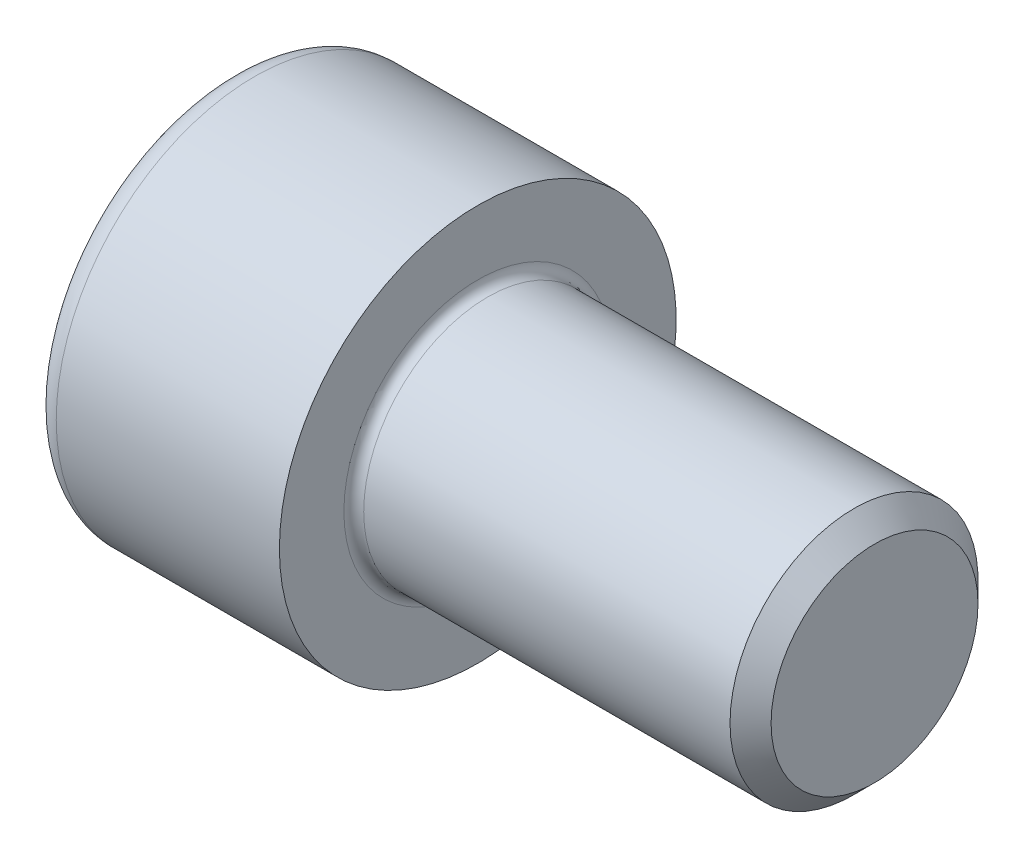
ISO-10303-21;
HEADER;
FILE_DESCRIPTION(('STEP AP214'),'2;1');
FILE_NAME('part.step','',(''),(''),'','','');
FILE_SCHEMA(('AUTOMOTIVE_DESIGN { 1 0 10303 214 1 1 1 1 }'));
ENDSEC;
DATA;
#1=APPLICATION_CONTEXT('core data for automotive mechanical design processes');
#2=APPLICATION_PROTOCOL_DEFINITION('international standard','automotive_design',2000,#1);
#3=PRODUCT_CONTEXT('',#1,'mechanical');
#4=PRODUCT('Part','Part','',(#3));
#5=PRODUCT_RELATED_PRODUCT_CATEGORY('part','',(#4));
#6=PRODUCT_DEFINITION_FORMATION('','',#4);
#7=PRODUCT_DEFINITION_CONTEXT('part definition',#1,'design');
#8=PRODUCT_DEFINITION('design','',#6,#7);
#9=PRODUCT_DEFINITION_SHAPE('','',#8);
#10=(LENGTH_UNIT() NAMED_UNIT(*) SI_UNIT(.MILLI.,.METRE.));
#11=(NAMED_UNIT(*) PLANE_ANGLE_UNIT() SI_UNIT($,.RADIAN.));
#12=(NAMED_UNIT(*) SI_UNIT($,.STERADIAN.) SOLID_ANGLE_UNIT());
#13=UNCERTAINTY_MEASURE_WITH_UNIT(LENGTH_MEASURE(1.E-05),#10,'distance_accuracy_value','');
#14=(GEOMETRIC_REPRESENTATION_CONTEXT(3) GLOBAL_UNCERTAINTY_ASSIGNED_CONTEXT((#13)) GLOBAL_UNIT_ASSIGNED_CONTEXT((#10,
#11,#12)) REPRESENTATION_CONTEXT('',''));
#15=CARTESIAN_POINT('',(0.,0.,0.));
#16=DIRECTION('',(0.,0.,1.));
#17=DIRECTION('',(1.,0.,0.));
#18=AXIS2_PLACEMENT_3D('',#15,#16,#17);
#19=CARTESIAN_POINT('',(0.,0.,0.));
#20=DIRECTION('',(-1.,0.,0.));
#21=DIRECTION('',(0.,0.,1.));
#22=AXIS2_PLACEMENT_3D('',#19,#20,#21);
#23=PLANE('',#22);
#24=DIRECTION('',(0.,-0.499999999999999,0.866025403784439));
#25=VECTOR('',#24,1.);
#26=CARTESIAN_POINT('',(0.,4.63323591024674,0.));
#27=LINE('',#26,#25);
#28=CARTESIAN_POINT('',(0.,4.63323591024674,0.));
#29=VERTEX_POINT('',#28);
#30=CARTESIAN_POINT('',(0.,2.31661795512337,4.01249999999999));
#31=VERTEX_POINT('',#30);
#32=EDGE_CURVE('E258',#29,#31,#27,.T.);
#33=ORIENTED_EDGE('',*,*,#32,.T.);
#34=DIRECTION('',(0.,1.,0.));
#35=VECTOR('',#34,1.);
#36=CARTESIAN_POINT('',(0.,-2.31661795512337,4.0125));
#37=LINE('',#36,#35);
#38=CARTESIAN_POINT('',(0.,-2.31661795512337,4.0125));
#39=VERTEX_POINT('',#38);
#40=EDGE_CURVE('E130',#39,#31,#37,.T.);
#41=ORIENTED_EDGE('',*,*,#40,.F.);
#42=DIRECTION('',(0.,-0.500000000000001,-0.866025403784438));
#43=VECTOR('',#42,1.);
#44=CARTESIAN_POINT('',(0.,-2.31661795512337,4.0125));
#45=LINE('',#44,#43);
#46=CARTESIAN_POINT('',(0.,-4.63323591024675,0.));
#47=VERTEX_POINT('',#46);
#48=EDGE_CURVE('E261',#39,#47,#45,.T.);
#49=ORIENTED_EDGE('',*,*,#48,.T.);
#50=DIRECTION('',(0.,0.499999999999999,-0.866025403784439));
#51=VECTOR('',#50,1.);
#52=CARTESIAN_POINT('',(0.,-4.63323591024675,0.));
#53=LINE('',#52,#51);
#54=CARTESIAN_POINT('',(0.,-2.31661795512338,-4.0125));
#55=VERTEX_POINT('',#54);
#56=EDGE_CURVE('E264',#47,#55,#53,.T.);
#57=ORIENTED_EDGE('',*,*,#56,.T.);
#58=DIRECTION('',(0.,-1.,0.));
#59=VECTOR('',#58,1.);
#60=CARTESIAN_POINT('',(0.,2.31661795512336,-4.0125));
#61=LINE('',#60,#59);
#62=CARTESIAN_POINT('',(0.,2.31661795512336,-4.0125));
#63=VERTEX_POINT('',#62);
#64=EDGE_CURVE('E267',#63,#55,#61,.T.);
#65=ORIENTED_EDGE('',*,*,#64,.F.);
#66=DIRECTION('',(0.,-0.500000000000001,-0.866025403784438));
#67=VECTOR('',#66,1.);
#68=CARTESIAN_POINT('',(0.,4.63323591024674,0.));
#69=LINE('',#68,#67);
#70=EDGE_CURVE('E125',#29,#63,#69,.T.);
#71=ORIENTED_EDGE('',*,*,#70,.F.);
#72=EDGE_LOOP('',(#33,#41,#49,#57,#65,#71));
#73=FACE_BOUND('',#72,.T.);
#74=CARTESIAN_POINT('',(0.,0.,0.));
#75=DIRECTION('',(-1.,0.,0.));
#76=DIRECTION('',(0.,0.,1.));
#77=AXIS2_PLACEMENT_3D('',#74,#75,#76);
#78=CIRCLE('',#77,7.);
#79=CARTESIAN_POINT('',(0.,0.,7.));
#80=VERTEX_POINT('',#79);
#81=EDGE_CURVE('E42',#80,#80,#78,.T.);
#82=ORIENTED_EDGE('',*,*,#81,.T.);
#83=EDGE_LOOP('',(#82));
#84=FACE_BOUND('',#83,.T.);
#85=ADVANCED_FACE('F34',(#73,#84),#23,.T.);
#86=CARTESIAN_POINT('',(-31.75,0.,0.));
#87=DIRECTION('',(-1.,0.,0.));
#88=DIRECTION('',(0.,0.,1.));
#89=AXIS2_PLACEMENT_3D('',#86,#87,#88);
#90=CYLINDRICAL_SURFACE('',#89,8.);
#91=CARTESIAN_POINT('',(1.,0.,0.));
#92=DIRECTION('',(-1.,0.,0.));
#93=DIRECTION('',(0.,0.,1.));
#94=AXIS2_PLACEMENT_3D('',#91,#92,#93);
#95=CIRCLE('',#94,8.);
#96=CARTESIAN_POINT('',(1.,0.,8.));
#97=VERTEX_POINT('',#96);
#98=EDGE_CURVE('E11',#97,#97,#95,.F.);
#99=ORIENTED_EDGE('',*,*,#98,.T.);
#100=EDGE_LOOP('',(#99));
#101=FACE_BOUND('',#100,.T.);
#102=CARTESIAN_POINT('',(9.99999999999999,0.,0.));
#103=DIRECTION('',(-1.,0.,0.));
#104=DIRECTION('',(0.,0.,1.));
#105=AXIS2_PLACEMENT_3D('',#102,#103,#104);
#106=CIRCLE('',#105,8.);
#107=CARTESIAN_POINT('',(9.99999999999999,0.,8.));
#108=VERTEX_POINT('',#107);
#109=EDGE_CURVE('E148',#108,#108,#106,.T.);
#110=ORIENTED_EDGE('',*,*,#109,.T.);
#111=EDGE_LOOP('',(#110));
#112=FACE_BOUND('',#111,.T.);
#113=ADVANCED_FACE('F172',(#101,#112),#90,.T.);
#114=CARTESIAN_POINT('',(10.,8.,0.));
#115=DIRECTION('',(1.,0.,0.));
#116=DIRECTION('',(0.,0.,-1.));
#117=AXIS2_PLACEMENT_3D('',#114,#115,#116);
#118=PLANE('',#117);
#119=CARTESIAN_POINT('',(10.,0.,0.));
#120=DIRECTION('',(1.,0.,0.));
#121=DIRECTION('',(0.,0.,-1.));
#122=AXIS2_PLACEMENT_3D('',#119,#120,#121);
#123=CIRCLE('',#122,5.4);
#124=CARTESIAN_POINT('',(10.,0.,-5.4));
#125=VERTEX_POINT('',#124);
#126=EDGE_CURVE('E151',#125,#125,#123,.F.);
#127=ORIENTED_EDGE('',*,*,#126,.T.);
#128=EDGE_LOOP('',(#127));
#129=FACE_BOUND('',#128,.T.);
#130=ORIENTED_EDGE('',*,*,#109,.F.);
#131=EDGE_LOOP('',(#130));
#132=FACE_BOUND('',#131,.T.);
#133=ADVANCED_FACE('F178',(#129,#132),#118,.T.);
#134=CARTESIAN_POINT('',(-31.75,0.,0.));
#135=DIRECTION('',(-1.,0.,0.));
#136=DIRECTION('',(0.,0.,1.));
#137=AXIS2_PLACEMENT_3D('',#134,#135,#136);
#138=CYLINDRICAL_SURFACE('',#137,5.);
#139=CARTESIAN_POINT('',(10.4,0.,0.));
#140=DIRECTION('',(1.,0.,0.));
#141=DIRECTION('',(0.,0.,-1.));
#142=AXIS2_PLACEMENT_3D('',#139,#140,#141);
#143=CIRCLE('',#142,5.);
#144=CARTESIAN_POINT('',(10.4,0.,-5.));
#145=VERTEX_POINT('',#144);
#146=EDGE_CURVE('E154',#145,#145,#143,.T.);
#147=ORIENTED_EDGE('',*,*,#146,.T.);
#148=EDGE_LOOP('',(#147));
#149=FACE_BOUND('',#148,.T.);
#150=CARTESIAN_POINT('',(25.172,0.,0.));
#151=DIRECTION('',(-1.,0.,0.));
#152=DIRECTION('',(0.,0.,1.));
#153=AXIS2_PLACEMENT_3D('',#150,#151,#152);
#154=CIRCLE('',#153,5.);
#155=CARTESIAN_POINT('',(25.172,0.,5.));
#156=VERTEX_POINT('',#155);
#157=EDGE_CURVE('E145',#156,#156,#154,.T.);
#158=ORIENTED_EDGE('',*,*,#157,.T.);
#159=EDGE_LOOP('',(#158));
#160=FACE_BOUND('',#159,.T.);
#161=ADVANCED_FACE('F184',(#149,#160),#138,.T.);
#162=CARTESIAN_POINT('',(26.,0.,0.));
#163=DIRECTION('',(-1.,0.,0.));
#164=DIRECTION('',(0.,0.,1.));
#165=AXIS2_PLACEMENT_3D('',#162,#163,#164);
#166=CONICAL_SURFACE('',#165,4.172,0.785398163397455);
#167=ORIENTED_EDGE('',*,*,#157,.F.);
#168=EDGE_LOOP('',(#167));
#169=FACE_BOUND('',#168,.T.);
#170=CARTESIAN_POINT('',(26.,0.,0.));
#171=DIRECTION('',(-1.,0.,0.));
#172=DIRECTION('',(0.,0.,1.));
#173=AXIS2_PLACEMENT_3D('',#170,#171,#172);
#174=CIRCLE('',#173,4.172);
#175=CARTESIAN_POINT('',(26.,0.,4.172));
#176=VERTEX_POINT('',#175);
#177=EDGE_CURVE('E141',#176,#176,#174,.T.);
#178=ORIENTED_EDGE('',*,*,#177,.T.);
#179=EDGE_LOOP('',(#178));
#180=FACE_BOUND('',#179,.T.);
#181=ADVANCED_FACE('F188',(#169,#180),#166,.T.);
#182=CARTESIAN_POINT('',(26.,4.172,0.));
#183=DIRECTION('',(1.,0.,0.));
#184=DIRECTION('',(0.,0.,-1.));
#185=AXIS2_PLACEMENT_3D('',#182,#183,#184);
#186=PLANE('',#185);
#187=ORIENTED_EDGE('',*,*,#177,.F.);
#188=EDGE_LOOP('',(#187));
#189=FACE_BOUND('',#188,.T.);
#190=ADVANCED_FACE('F168',(#189),#186,.T.);
#191=CARTESIAN_POINT('',(10.4,0.,0.));
#192=DIRECTION('',(1.,0.,0.));
#193=DIRECTION('',(0.,0.,-1.));
#194=AXIS2_PLACEMENT_3D('',#191,#192,#193);
#195=TOROIDAL_SURFACE('',#194,5.4,0.4);
#196=ORIENTED_EDGE('',*,*,#146,.F.);
#197=EDGE_LOOP('',(#196));
#198=FACE_BOUND('',#197,.T.);
#199=ORIENTED_EDGE('',*,*,#126,.F.);
#200=EDGE_LOOP('',(#199));
#201=FACE_BOUND('',#200,.T.);
#202=ADVANCED_FACE('F161',(#198,#201),#195,.F.);
#203=CARTESIAN_POINT('',(1.,0.,0.));
#204=DIRECTION('',(-1.,0.,0.));
#205=DIRECTION('',(0.,0.,1.));
#206=AXIS2_PLACEMENT_3D('',#203,#204,#205);
#207=TOROIDAL_SURFACE('',#206,7.,1.);
#208=ORIENTED_EDGE('',*,*,#98,.F.);
#209=EDGE_LOOP('',(#208));
#210=FACE_BOUND('',#209,.T.);
#211=ORIENTED_EDGE('',*,*,#81,.F.);
#212=EDGE_LOOP('',(#211));
#213=FACE_BOUND('',#212,.T.);
#214=ADVANCED_FACE('F36',(#210,#213),#207,.T.);
#215=CARTESIAN_POINT('',(5.,4.63323591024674,0.));
#216=DIRECTION('',(0.,-0.866025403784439,-0.499999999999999));
#217=DIRECTION('',(0.,0.499999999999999,-0.866025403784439));
#218=AXIS2_PLACEMENT_3D('',#215,#216,#217);
#219=PLANE('',#218);
#220=ORIENTED_EDGE('',*,*,#32,.F.);
#221=DIRECTION('',(-1.,0.,0.));
#222=VECTOR('',#221,1.);
#223=CARTESIAN_POINT('',(5.,4.63323591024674,0.));
#224=LINE('',#223,#222);
#225=CARTESIAN_POINT('',(5.,4.63323591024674,0.));
#226=VERTEX_POINT('',#225);
#227=EDGE_CURVE('E248',#226,#29,#224,.T.);
#228=ORIENTED_EDGE('',*,*,#227,.F.);
#229=DIRECTION('',(0.,-0.499999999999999,0.866025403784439));
#230=VECTOR('',#229,1.);
#231=CARTESIAN_POINT('',(5.,4.63323591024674,0.));
#232=LINE('',#231,#230);
#233=CARTESIAN_POINT('',(5.,3.47492693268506,2.00624999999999));
#234=VERTEX_POINT('',#233);
#235=EDGE_CURVE('E117',#226,#234,#232,.T.);
#236=ORIENTED_EDGE('',*,*,#235,.T.);
#237=CARTESIAN_POINT('',(5.,2.31661795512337,4.01249999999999));
#238=VERTEX_POINT('',#237);
#239=EDGE_CURVE('E108',#234,#238,#232,.T.);
#240=ORIENTED_EDGE('',*,*,#239,.T.);
#241=DIRECTION('',(-1.,0.,0.));
#242=VECTOR('',#241,1.);
#243=CARTESIAN_POINT('',(5.,2.31661795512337,4.01249999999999));
#244=LINE('',#243,#242);
#245=EDGE_CURVE('E122',#238,#31,#244,.T.);
#246=ORIENTED_EDGE('',*,*,#245,.T.);
#247=EDGE_LOOP('',(#220,#228,#236,#240,#246));
#248=FACE_BOUND('',#247,.T.);
#249=ADVANCED_FACE('F121',(#248),#219,.T.);
#250=CARTESIAN_POINT('',(5.,-2.31661795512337,4.0125));
#251=DIRECTION('',(0.,0.,1.));
#252=DIRECTION('',(0.,-1.,0.));
#253=AXIS2_PLACEMENT_3D('',#250,#251,#252);
#254=PLANE('',#253);
#255=ORIENTED_EDGE('',*,*,#40,.T.);
#256=ORIENTED_EDGE('',*,*,#245,.F.);
#257=DIRECTION('',(0.,1.,0.));
#258=VECTOR('',#257,1.);
#259=CARTESIAN_POINT('',(5.,-2.31661795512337,4.0125));
#260=LINE('',#259,#258);
#261=CARTESIAN_POINT('',(5.,0.,4.0125));
#262=VERTEX_POINT('',#261);
#263=EDGE_CURVE('E105',#262,#238,#260,.T.);
#264=ORIENTED_EDGE('',*,*,#263,.F.);
#265=CARTESIAN_POINT('',(5.,-2.31661795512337,4.0125));
#266=VERTEX_POINT('',#265);
#267=EDGE_CURVE('E116',#266,#262,#260,.T.);
#268=ORIENTED_EDGE('',*,*,#267,.F.);
#269=DIRECTION('',(-1.,0.,0.));
#270=VECTOR('',#269,1.);
#271=CARTESIAN_POINT('',(5.,-2.31661795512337,4.0125));
#272=LINE('',#271,#270);
#273=EDGE_CURVE('E132',#266,#39,#272,.T.);
#274=ORIENTED_EDGE('',*,*,#273,.T.);
#275=EDGE_LOOP('',(#255,#256,#264,#268,#274));
#276=FACE_BOUND('',#275,.T.);
#277=ADVANCED_FACE('F127',(#276),#254,.F.);
#278=CARTESIAN_POINT('',(5.,-2.31661795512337,4.0125));
#279=DIRECTION('',(0.,0.866025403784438,-0.500000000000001));
#280=DIRECTION('',(0.,0.500000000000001,0.866025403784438));
#281=AXIS2_PLACEMENT_3D('',#278,#279,#280);
#282=PLANE('',#281);
#283=ORIENTED_EDGE('',*,*,#48,.F.);
#284=ORIENTED_EDGE('',*,*,#273,.F.);
#285=DIRECTION('',(0.,-0.500000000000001,-0.866025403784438));
#286=VECTOR('',#285,1.);
#287=CARTESIAN_POINT('',(5.,-2.31661795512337,4.0125));
#288=LINE('',#287,#286);
#289=CARTESIAN_POINT('',(5.,-3.47492693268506,2.00625));
#290=VERTEX_POINT('',#289);
#291=EDGE_CURVE('E287',#266,#290,#288,.T.);
#292=ORIENTED_EDGE('',*,*,#291,.T.);
#293=CARTESIAN_POINT('',(5.,-4.63323591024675,0.));
#294=VERTEX_POINT('',#293);
#295=EDGE_CURVE('E276',#290,#294,#288,.T.);
#296=ORIENTED_EDGE('',*,*,#295,.T.);
#297=DIRECTION('',(-1.,0.,0.));
#298=VECTOR('',#297,1.);
#299=CARTESIAN_POINT('',(5.,-4.63323591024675,0.));
#300=LINE('',#299,#298);
#301=EDGE_CURVE('E137',#294,#47,#300,.T.);
#302=ORIENTED_EDGE('',*,*,#301,.T.);
#303=EDGE_LOOP('',(#283,#284,#292,#296,#302));
#304=FACE_BOUND('',#303,.T.);
#305=ADVANCED_FACE('F202',(#304),#282,.T.);
#306=CARTESIAN_POINT('',(5.,-4.63323591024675,0.));
#307=DIRECTION('',(0.,0.866025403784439,0.499999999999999));
#308=DIRECTION('',(0.,-0.499999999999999,0.866025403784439));
#309=AXIS2_PLACEMENT_3D('',#306,#307,#308);
#310=PLANE('',#309);
#311=ORIENTED_EDGE('',*,*,#56,.F.);
#312=ORIENTED_EDGE('',*,*,#301,.F.);
#313=DIRECTION('',(0.,0.499999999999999,-0.866025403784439));
#314=VECTOR('',#313,1.);
#315=CARTESIAN_POINT('',(5.,-4.63323591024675,0.));
#316=LINE('',#315,#314);
#317=CARTESIAN_POINT('',(5.,-3.47492693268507,-2.00625));
#318=VERTEX_POINT('',#317);
#319=EDGE_CURVE('E254',#294,#318,#316,.T.);
#320=ORIENTED_EDGE('',*,*,#319,.T.);
#321=CARTESIAN_POINT('',(5.,-2.31661795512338,-4.0125));
#322=VERTEX_POINT('',#321);
#323=EDGE_CURVE('E286',#318,#322,#316,.T.);
#324=ORIENTED_EDGE('',*,*,#323,.T.);
#325=DIRECTION('',(-1.,0.,0.));
#326=VECTOR('',#325,1.);
#327=CARTESIAN_POINT('',(5.,-2.31661795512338,-4.0125));
#328=LINE('',#327,#326);
#329=EDGE_CURVE('E247',#322,#55,#328,.T.);
#330=ORIENTED_EDGE('',*,*,#329,.T.);
#331=EDGE_LOOP('',(#311,#312,#320,#324,#330));
#332=FACE_BOUND('',#331,.T.);
#333=ADVANCED_FACE('F205',(#332),#310,.T.);
#334=CARTESIAN_POINT('',(5.,2.31661795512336,-4.0125));
#335=DIRECTION('',(0.,0.,-1.));
#336=DIRECTION('',(0.,1.,0.));
#337=AXIS2_PLACEMENT_3D('',#334,#335,#336);
#338=PLANE('',#337);
#339=ORIENTED_EDGE('',*,*,#64,.T.);
#340=ORIENTED_EDGE('',*,*,#329,.F.);
#341=DIRECTION('',(0.,-1.,0.));
#342=VECTOR('',#341,1.);
#343=CARTESIAN_POINT('',(5.,2.31661795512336,-4.0125));
#344=LINE('',#343,#342);
#345=CARTESIAN_POINT('',(5.,0.,-4.0125));
#346=VERTEX_POINT('',#345);
#347=EDGE_CURVE('E251',#346,#322,#344,.T.);
#348=ORIENTED_EDGE('',*,*,#347,.F.);
#349=CARTESIAN_POINT('',(5.,2.31661795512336,-4.0125));
#350=VERTEX_POINT('',#349);
#351=EDGE_CURVE('E49',#350,#346,#344,.T.);
#352=ORIENTED_EDGE('',*,*,#351,.F.);
#353=DIRECTION('',(-1.,0.,0.));
#354=VECTOR('',#353,1.);
#355=CARTESIAN_POINT('',(5.,2.31661795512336,-4.0125));
#356=LINE('',#355,#354);
#357=EDGE_CURVE('E244',#350,#63,#356,.T.);
#358=ORIENTED_EDGE('',*,*,#357,.T.);
#359=EDGE_LOOP('',(#339,#340,#348,#352,#358));
#360=FACE_BOUND('',#359,.T.);
#361=ADVANCED_FACE('F209',(#360),#338,.F.);
#362=CARTESIAN_POINT('',(5.,4.63323591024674,0.));
#363=DIRECTION('',(0.,0.866025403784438,-0.500000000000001));
#364=DIRECTION('',(0.,0.500000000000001,0.866025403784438));
#365=AXIS2_PLACEMENT_3D('',#362,#363,#364);
#366=PLANE('',#365);
#367=ORIENTED_EDGE('',*,*,#70,.T.);
#368=ORIENTED_EDGE('',*,*,#357,.F.);
#369=DIRECTION('',(0.,-0.500000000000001,-0.866025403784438));
#370=VECTOR('',#369,1.);
#371=CARTESIAN_POINT('',(5.,4.63323591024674,0.));
#372=LINE('',#371,#370);
#373=CARTESIAN_POINT('',(5.,3.47492693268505,-2.00625));
#374=VERTEX_POINT('',#373);
#375=EDGE_CURVE('E234',#374,#350,#372,.T.);
#376=ORIENTED_EDGE('',*,*,#375,.F.);
#377=EDGE_CURVE('E240',#226,#374,#372,.T.);
#378=ORIENTED_EDGE('',*,*,#377,.F.);
#379=ORIENTED_EDGE('',*,*,#227,.T.);
#380=EDGE_LOOP('',(#367,#368,#376,#378,#379));
#381=FACE_BOUND('',#380,.T.);
#382=ADVANCED_FACE('F213',(#381),#366,.F.);
#383=CARTESIAN_POINT('',(5.,4.63323591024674,0.));
#384=DIRECTION('',(1.,0.,0.));
#385=DIRECTION('',(0.,0.,-1.));
#386=AXIS2_PLACEMENT_3D('',#383,#384,#385);
#387=PLANE('',#386);
#388=ORIENTED_EDGE('',*,*,#347,.T.);
#389=ORIENTED_EDGE('',*,*,#323,.F.);
#390=CARTESIAN_POINT('',(5.,0.,0.));
#391=DIRECTION('',(-1.,0.,0.));
#392=DIRECTION('',(0.,0.,1.));
#393=AXIS2_PLACEMENT_3D('',#390,#391,#392);
#394=CIRCLE('',#393,4.0125);
#395=EDGE_CURVE('E282',#346,#318,#394,.T.);
#396=ORIENTED_EDGE('',*,*,#395,.F.);
#397=EDGE_LOOP('',(#388,#389,#396));
#398=FACE_BOUND('',#397,.T.);
#399=ADVANCED_FACE('F217',(#398),#387,.F.);
#400=ORIENTED_EDGE('',*,*,#319,.F.);
#401=ORIENTED_EDGE('',*,*,#295,.F.);
#402=EDGE_CURVE('E135',#318,#290,#394,.T.);
#403=ORIENTED_EDGE('',*,*,#402,.F.);
#404=EDGE_LOOP('',(#400,#401,#403));
#405=FACE_BOUND('',#404,.T.);
#406=ADVANCED_FACE('F220',(#405),#387,.F.);
#407=ORIENTED_EDGE('',*,*,#291,.F.);
#408=ORIENTED_EDGE('',*,*,#267,.T.);
#409=EDGE_CURVE('E131',#290,#262,#394,.T.);
#410=ORIENTED_EDGE('',*,*,#409,.F.);
#411=EDGE_LOOP('',(#407,#408,#410));
#412=FACE_BOUND('',#411,.T.);
#413=ADVANCED_FACE('F225',(#412),#387,.F.);
#414=ORIENTED_EDGE('',*,*,#263,.T.);
#415=ORIENTED_EDGE('',*,*,#239,.F.);
#416=EDGE_CURVE('E111',#262,#234,#394,.T.);
#417=ORIENTED_EDGE('',*,*,#416,.F.);
#418=EDGE_LOOP('',(#414,#415,#417));
#419=FACE_BOUND('',#418,.T.);
#420=ADVANCED_FACE('F107',(#419),#387,.F.);
#421=ORIENTED_EDGE('',*,*,#235,.F.);
#422=ORIENTED_EDGE('',*,*,#377,.T.);
#423=EDGE_CURVE('E142',#234,#374,#394,.T.);
#424=ORIENTED_EDGE('',*,*,#423,.F.);
#425=EDGE_LOOP('',(#421,#422,#424));
#426=FACE_BOUND('',#425,.T.);
#427=ADVANCED_FACE('F228',(#426),#387,.F.);
#428=ORIENTED_EDGE('',*,*,#375,.T.);
#429=ORIENTED_EDGE('',*,*,#351,.T.);
#430=EDGE_CURVE('E237',#374,#346,#394,.T.);
#431=ORIENTED_EDGE('',*,*,#430,.F.);
#432=EDGE_LOOP('',(#428,#429,#431));
#433=FACE_BOUND('',#432,.T.);
#434=ADVANCED_FACE('F198',(#433),#387,.F.);
#435=CARTESIAN_POINT('',(5.,0.,0.));
#436=DIRECTION('',(-1.,0.,0.));
#437=DIRECTION('',(0.,0.,1.));
#438=AXIS2_PLACEMENT_3D('',#435,#436,#437);
#439=CONICAL_SURFACE('',#438,4.0125,1.04719755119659);
#440=CARTESIAN_POINT('',(7.31661795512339,0.,0.));
#441=VERTEX_POINT('',#440);
#442=VERTEX_LOOP('',#441);
#443=FACE_BOUND('',#442,.T.);
#444=ORIENTED_EDGE('',*,*,#416,.T.);
#445=ORIENTED_EDGE('',*,*,#423,.T.);
#446=ORIENTED_EDGE('',*,*,#430,.T.);
#447=ORIENTED_EDGE('',*,*,#395,.T.);
#448=ORIENTED_EDGE('',*,*,#402,.T.);
#449=ORIENTED_EDGE('',*,*,#409,.T.);
#450=EDGE_LOOP('',(#444,#445,#446,#447,#448,#449));
#451=FACE_BOUND('',#450,.T.);
#452=ADVANCED_FACE('F196',(#443,#451),#439,.F.);
#453=CLOSED_SHELL('',(#85,#113,#133,#161,#181,#190,#202,#214,#249,#277,#305,#333,#361,#382,#399,
#406,#413,#420,#427,#434,#452));
#454=MANIFOLD_SOLID_BREP('B2',#453);
#455=ADVANCED_BREP_SHAPE_REPRESENTATION('',(#18,#454),#14);
#456=SHAPE_DEFINITION_REPRESENTATION(#9,#455);
ENDSEC;
END-ISO-10303-21;
